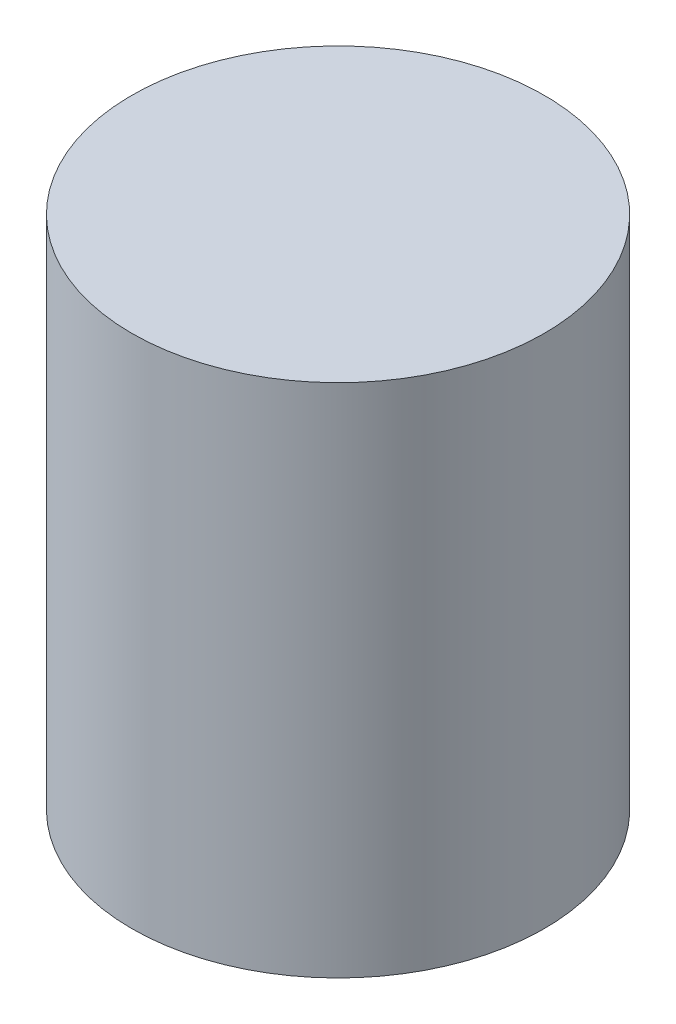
from build123d import *

# Parameters (mm, degrees)
SKETCH_1_R      = 30
EXTRUDE_1_DEPTH = 75


with BuildPart() as part:
    # Sketch 1 → Extrude 1 (new body)
    with BuildSketch(Plane(origin=(0, 0, 0), x_dir=(1, 0, 0), z_dir=(0, 1, 0))):
        with Locations(Location((0, 0, 0), (0, 0, 270))):
            Circle(SKETCH_1_R)
    extrude(amount=EXTRUDE_1_DEPTH)


solid = part.part
